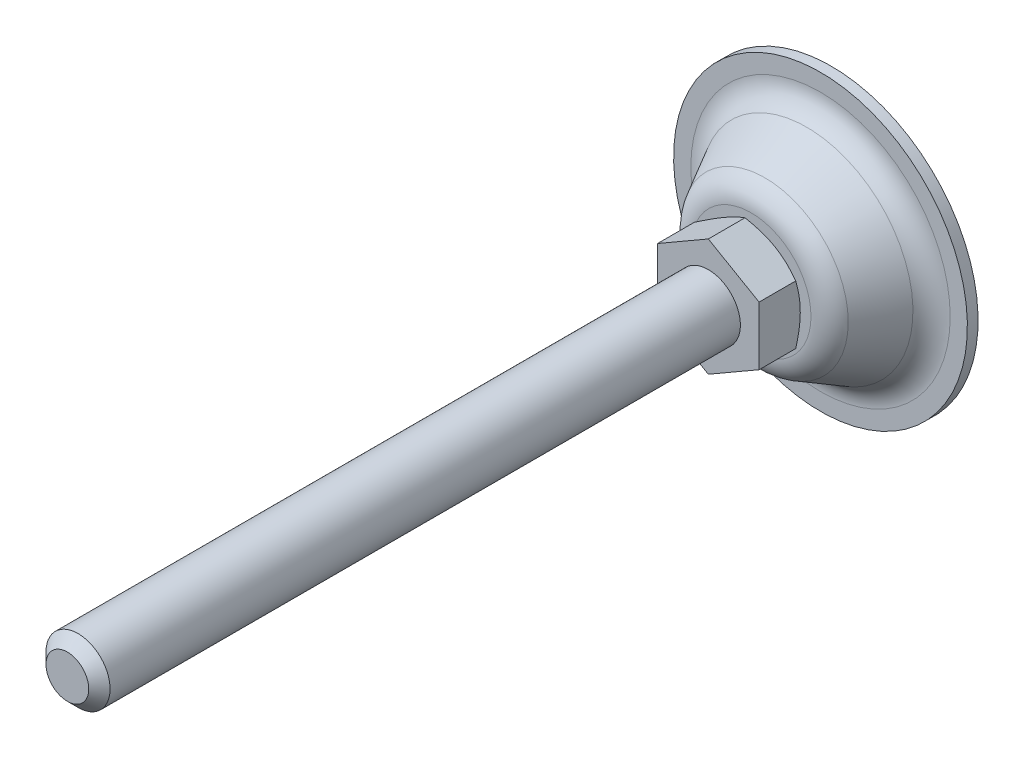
ISO-10303-21;
HEADER;
FILE_DESCRIPTION(('STEP AP214'),'2;1');
FILE_NAME('part.step','',(''),(''),'','','');
FILE_SCHEMA(('AUTOMOTIVE_DESIGN { 1 0 10303 214 1 1 1 1 }'));
ENDSEC;
DATA;
#1=APPLICATION_CONTEXT('core data for automotive mechanical design processes');
#2=APPLICATION_PROTOCOL_DEFINITION('international standard','automotive_design',2000,#1);
#3=PRODUCT_CONTEXT('',#1,'mechanical');
#4=PRODUCT('Part','Part','',(#3));
#5=PRODUCT_RELATED_PRODUCT_CATEGORY('part','',(#4));
#6=PRODUCT_DEFINITION_FORMATION('','',#4);
#7=PRODUCT_DEFINITION_CONTEXT('part definition',#1,'design');
#8=PRODUCT_DEFINITION('design','',#6,#7);
#9=PRODUCT_DEFINITION_SHAPE('','',#8);
#10=(LENGTH_UNIT() NAMED_UNIT(*) SI_UNIT(.MILLI.,.METRE.));
#11=(NAMED_UNIT(*) PLANE_ANGLE_UNIT() SI_UNIT($,.RADIAN.));
#12=(NAMED_UNIT(*) SI_UNIT($,.STERADIAN.) SOLID_ANGLE_UNIT());
#13=UNCERTAINTY_MEASURE_WITH_UNIT(LENGTH_MEASURE(1.E-05),#10,'distance_accuracy_value','');
#14=(GEOMETRIC_REPRESENTATION_CONTEXT(3) GLOBAL_UNCERTAINTY_ASSIGNED_CONTEXT((#13)) GLOBAL_UNIT_ASSIGNED_CONTEXT((#10,
#11,#12)) REPRESENTATION_CONTEXT('',''));
#15=CARTESIAN_POINT('',(0.,0.,0.));
#16=DIRECTION('',(0.,0.,1.));
#17=DIRECTION('',(1.,0.,0.));
#18=AXIS2_PLACEMENT_3D('',#15,#16,#17);
#19=CARTESIAN_POINT('',(0.,0.,23.));
#20=DIRECTION('',(0.,0.,1.));
#21=DIRECTION('',(0.5,-0.866025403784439,0.));
#22=AXIS2_PLACEMENT_3D('',#19,#20,#21);
#23=PLANE('',#22);
#24=DIRECTION('',(0.,1.,0.));
#25=VECTOR('',#24,1.);
#26=CARTESIAN_POINT('',(9.5,-5.48482755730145,23.));
#27=LINE('',#26,#25);
#28=CARTESIAN_POINT('',(9.5,-5.48482755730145,23.));
#29=VERTEX_POINT('',#28);
#30=CARTESIAN_POINT('',(9.5,5.48482755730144,23.));
#31=VERTEX_POINT('',#30);
#32=EDGE_CURVE('E218',#29,#31,#27,.T.);
#33=ORIENTED_EDGE('',*,*,#32,.T.);
#34=DIRECTION('',(-0.866025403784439,0.5,0.));
#35=VECTOR('',#34,1.);
#36=CARTESIAN_POINT('',(9.5,5.48482755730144,23.));
#37=LINE('',#36,#35);
#38=CARTESIAN_POINT('',(0.,10.9696551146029,23.));
#39=VERTEX_POINT('',#38);
#40=EDGE_CURVE('E359',#31,#39,#37,.T.);
#41=ORIENTED_EDGE('',*,*,#40,.T.);
#42=DIRECTION('',(-0.866025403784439,-0.5,0.));
#43=VECTOR('',#42,1.);
#44=CARTESIAN_POINT('',(0.,10.9696551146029,23.));
#45=LINE('',#44,#43);
#46=CARTESIAN_POINT('',(-9.5,5.48482755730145,23.));
#47=VERTEX_POINT('',#46);
#48=EDGE_CURVE('E358',#39,#47,#45,.T.);
#49=ORIENTED_EDGE('',*,*,#48,.T.);
#50=DIRECTION('',(0.,-1.,0.));
#51=VECTOR('',#50,1.);
#52=CARTESIAN_POINT('',(-9.5,5.48482755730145,23.));
#53=LINE('',#52,#51);
#54=CARTESIAN_POINT('',(-9.5,-5.48482755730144,23.));
#55=VERTEX_POINT('',#54);
#56=EDGE_CURVE('E363',#47,#55,#53,.T.);
#57=ORIENTED_EDGE('',*,*,#56,.T.);
#58=DIRECTION('',(0.866025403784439,-0.5,0.));
#59=VECTOR('',#58,1.);
#60=CARTESIAN_POINT('',(-9.5,-5.48482755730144,23.));
#61=LINE('',#60,#59);
#62=CARTESIAN_POINT('',(0.,-10.9696551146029,23.));
#63=VERTEX_POINT('',#62);
#64=EDGE_CURVE('E365',#55,#63,#61,.T.);
#65=ORIENTED_EDGE('',*,*,#64,.T.);
#66=DIRECTION('',(0.866025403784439,0.5,0.));
#67=VECTOR('',#66,1.);
#68=CARTESIAN_POINT('',(0.,-10.9696551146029,23.));
#69=LINE('',#68,#67);
#70=EDGE_CURVE('E37',#63,#29,#69,.T.);
#71=ORIENTED_EDGE('',*,*,#70,.T.);
#72=EDGE_LOOP('',(#33,#41,#49,#57,#65,#71));
#73=FACE_BOUND('',#72,.T.);
#74=CARTESIAN_POINT('',(0.,0.,23.));
#75=DIRECTION('',(0.,0.,1.));
#76=DIRECTION('',(0.5,-0.866025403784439,0.));
#77=AXIS2_PLACEMENT_3D('',#74,#75,#76);
#78=CIRCLE('',#77,6.);
#79=CARTESIAN_POINT('',(3.,-5.19615242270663,23.));
#80=VERTEX_POINT('',#79);
#81=EDGE_CURVE('E222',#80,#80,#78,.T.);
#82=ORIENTED_EDGE('',*,*,#81,.F.);
#83=EDGE_LOOP('',(#82));
#84=FACE_BOUND('',#83,.T.);
#85=ADVANCED_FACE('F14',(#73,#84),#23,.T.);
#86=CARTESIAN_POINT('',(0.,0.,15.));
#87=DIRECTION('',(0.,0.,1.));
#88=DIRECTION('',(0.5,-0.866025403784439,0.));
#89=AXIS2_PLACEMENT_3D('',#86,#87,#88);
#90=PLANE('',#89);
#91=CARTESIAN_POINT('',(0.,0.,15.));
#92=DIRECTION('',(0.,0.,-1.));
#93=DIRECTION('',(-0.5,0.866025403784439,0.));
#94=AXIS2_PLACEMENT_3D('',#91,#92,#93);
#95=CIRCLE('',#94,11.2198194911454);
#96=CARTESIAN_POINT('',(-5.60990974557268,9.71664870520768,15.));
#97=VERTEX_POINT('',#96);
#98=EDGE_CURVE('E102',#97,#97,#95,.T.);
#99=ORIENTED_EDGE('',*,*,#98,.F.);
#100=EDGE_LOOP('',(#99));
#101=FACE_BOUND('',#100,.T.);
#102=CARTESIAN_POINT('',(0.,0.,15.));
#103=DIRECTION('',(0.,0.,-1.));
#104=DIRECTION('',(-0.5,0.866025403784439,0.));
#105=AXIS2_PLACEMENT_3D('',#102,#103,#104);
#106=CIRCLE('',#105,9.);
#107=CARTESIAN_POINT('',(-4.5,7.79422863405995,15.));
#108=VERTEX_POINT('',#107);
#109=EDGE_CURVE('E84',#108,#108,#106,.T.);
#110=ORIENTED_EDGE('',*,*,#109,.T.);
#111=EDGE_LOOP('',(#110));
#112=FACE_BOUND('',#111,.T.);
#113=ADVANCED_FACE('F183',(#101,#112),#90,.T.);
#114=CARTESIAN_POINT('',(0.,0.,0.));
#115=DIRECTION('',(0.,0.,-1.));
#116=DIRECTION('',(-0.5,0.866025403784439,0.));
#117=AXIS2_PLACEMENT_3D('',#114,#115,#116);
#118=PLANE('',#117);
#119=CARTESIAN_POINT('',(0.,0.,0.));
#120=DIRECTION('',(0.,0.,-1.));
#121=DIRECTION('',(-0.5,0.866025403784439,0.));
#122=AXIS2_PLACEMENT_3D('',#119,#120,#121);
#123=CIRCLE('',#122,27.5);
#124=CARTESIAN_POINT('',(-13.75,23.8156986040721,0.));
#125=VERTEX_POINT('',#124);
#126=EDGE_CURVE('E73',#125,#125,#123,.T.);
#127=ORIENTED_EDGE('',*,*,#126,.T.);
#128=EDGE_LOOP('',(#127));
#129=FACE_BOUND('',#128,.T.);
#130=ADVANCED_FACE('F186',(#129),#118,.T.);
#131=CARTESIAN_POINT('',(0.,0.,-9.3525294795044));
#132=DIRECTION('',(0.,0.,-1.));
#133=DIRECTION('',(-0.5,0.866025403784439,0.));
#134=AXIS2_PLACEMENT_3D('',#131,#132,#133);
#135=CYLINDRICAL_SURFACE('',#134,27.5);
#136=CARTESIAN_POINT('',(0.,0.,2.));
#137=DIRECTION('',(0.,0.,-1.));
#138=DIRECTION('',(-0.5,0.866025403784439,0.));
#139=AXIS2_PLACEMENT_3D('',#136,#137,#138);
#140=CIRCLE('',#139,27.5);
#141=CARTESIAN_POINT('',(-13.75,23.8156986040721,2.));
#142=VERTEX_POINT('',#141);
#143=EDGE_CURVE('E114',#142,#142,#140,.T.);
#144=ORIENTED_EDGE('',*,*,#143,.T.);
#145=EDGE_LOOP('',(#144));
#146=FACE_BOUND('',#145,.T.);
#147=ORIENTED_EDGE('',*,*,#126,.F.);
#148=EDGE_LOOP('',(#147));
#149=FACE_BOUND('',#148,.T.);
#150=ADVANCED_FACE('F202',(#146,#149),#135,.T.);
#151=CARTESIAN_POINT('',(-13.75,23.8156986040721,2.));
#152=DIRECTION('',(0.,0.,1.));
#153=DIRECTION('',(0.5,-0.866025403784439,0.));
#154=AXIS2_PLACEMENT_3D('',#151,#152,#153);
#155=PLANE('',#154);
#156=CARTESIAN_POINT('',(0.,0.,2.));
#157=DIRECTION('',(0.,0.,-1.));
#158=DIRECTION('',(-0.5,0.866025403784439,0.));
#159=AXIS2_PLACEMENT_3D('',#156,#157,#158);
#160=CIRCLE('',#159,24.2801624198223);
#161=CARTESIAN_POINT('',(-12.1400812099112,21.0272374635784,2.));
#162=VERTEX_POINT('',#161);
#163=EDGE_CURVE('E111',#162,#162,#160,.T.);
#164=ORIENTED_EDGE('',*,*,#163,.T.);
#165=EDGE_LOOP('',(#164));
#166=FACE_BOUND('',#165,.T.);
#167=ORIENTED_EDGE('',*,*,#143,.F.);
#168=EDGE_LOOP('',(#167));
#169=FACE_BOUND('',#168,.T.);
#170=ADVANCED_FACE('F198',(#166,#169),#155,.T.);
#171=CARTESIAN_POINT('',(0.,0.,7.));
#172=DIRECTION('',(0.,0.,-1.));
#173=DIRECTION('',(-0.5,0.866025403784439,0.));
#174=AXIS2_PLACEMENT_3D('',#171,#172,#173);
#175=TOROIDAL_SURFACE('',#174,24.2801624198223,5.);
#176=CARTESIAN_POINT('',(0.,0.,4.59142577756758));
#177=DIRECTION('',(0.,0.,-1.));
#178=DIRECTION('',(-0.5,0.866025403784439,0.));
#179=AXIS2_PLACEMENT_3D('',#176,#177,#178);
#180=CIRCLE('',#179,19.8985222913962);
#181=CARTESIAN_POINT('',(-9.9492611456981,17.2326258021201,4.59142577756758));
#182=VERTEX_POINT('',#181);
#183=EDGE_CURVE('E108',#182,#182,#180,.T.);
#184=ORIENTED_EDGE('',*,*,#183,.T.);
#185=EDGE_LOOP('',(#184));
#186=FACE_BOUND('',#185,.T.);
#187=ORIENTED_EDGE('',*,*,#163,.F.);
#188=EDGE_LOOP('',(#187));
#189=FACE_BOUND('',#188,.T.);
#190=ADVANCED_FACE('F194',(#186,#189),#175,.F.);
#191=CARTESIAN_POINT('',(0.,0.,4.59142577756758));
#192=DIRECTION('',(0.,0.,-1.));
#193=DIRECTION('',(-0.5,0.866025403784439,0.));
#194=AXIS2_PLACEMENT_3D('',#191,#192,#193);
#195=CONICAL_SURFACE('',#194,19.8985222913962,0.50261051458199);
#196=CARTESIAN_POINT('',(0.,0.,12.4085742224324));
#197=DIRECTION('',(0.,0.,-1.));
#198=DIRECTION('',(-0.5,0.866025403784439,0.));
#199=AXIS2_PLACEMENT_3D('',#196,#197,#198);
#200=CIRCLE('',#199,15.6014596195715);
#201=CARTESIAN_POINT('',(-7.80072980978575,13.511260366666,12.4085742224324));
#202=VERTEX_POINT('',#201);
#203=EDGE_CURVE('E105',#202,#202,#200,.T.);
#204=ORIENTED_EDGE('',*,*,#203,.T.);
#205=EDGE_LOOP('',(#204));
#206=FACE_BOUND('',#205,.T.);
#207=ORIENTED_EDGE('',*,*,#183,.F.);
#208=EDGE_LOOP('',(#207));
#209=FACE_BOUND('',#208,.T.);
#210=ADVANCED_FACE('F190',(#206,#209),#195,.T.);
#211=CARTESIAN_POINT('',(0.,0.,10.));
#212=DIRECTION('',(0.,0.,-1.));
#213=DIRECTION('',(-0.5,0.866025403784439,0.));
#214=AXIS2_PLACEMENT_3D('',#211,#212,#213);
#215=TOROIDAL_SURFACE('',#214,11.2198194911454,5.);
#216=ORIENTED_EDGE('',*,*,#98,.T.);
#217=EDGE_LOOP('',(#216));
#218=FACE_BOUND('',#217,.T.);
#219=ORIENTED_EDGE('',*,*,#203,.F.);
#220=EDGE_LOOP('',(#219));
#221=FACE_BOUND('',#220,.T.);
#222=ADVANCED_FACE('F130',(#218,#221),#215,.T.);
#223=CARTESIAN_POINT('',(0.,0.,18.9793107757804));
#224=DIRECTION('',(0.,0.,1.));
#225=DIRECTION('',(0.5,-0.866025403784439,0.));
#226=AXIS2_PLACEMENT_3D('',#223,#224,#225);
#227=CONICAL_SURFACE('',#226,15.8923684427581,1.0471975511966);
#228=ORIENTED_EDGE('',*,*,#109,.F.);
#229=EDGE_LOOP('',(#228));
#230=FACE_BOUND('',#229,.T.);
#231=CARTESIAN_POINT('',(-8.15701159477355,-15.6791079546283,20.0079523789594));
#232=CARTESIAN_POINT('',(-7.97671168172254,-15.5750117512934,19.9065949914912));
#233=CARTESIAN_POINT('',(-7.79620414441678,-15.4707956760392,19.8057302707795));
#234=CARTESIAN_POINT('',(-7.43473055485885,-15.262098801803,19.6050974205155));
#235=CARTESIAN_POINT('',(-7.25376449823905,-15.1576180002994,19.5053293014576));
#236=CARTESIAN_POINT('',(-6.71006743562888,-14.8437143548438,19.2078115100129));
#237=CARTESIAN_POINT('',(-6.34658864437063,-14.6338597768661,19.0118772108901));
#238=CARTESIAN_POINT('',(-5.6153393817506,-14.2116728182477,18.6249838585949));
#239=CARTESIAN_POINT('',(-5.24755640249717,-13.9993332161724,18.4340562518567));
#240=CARTESIAN_POINT('',(-4.5091170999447,-13.5729950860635,18.059786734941));
#241=CARTESIAN_POINT('',(-4.13846090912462,-13.3589966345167,17.8764444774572));
#242=CARTESIAN_POINT('',(-3.38118032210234,-12.9217804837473,17.5133517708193));
#243=CARTESIAN_POINT('',(-2.99443761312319,-12.6984944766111,17.3339285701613));
#244=CARTESIAN_POINT('',(-2.21648353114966,-12.2493424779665,16.9882522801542));
#245=CARTESIAN_POINT('',(-1.82527167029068,-12.0234762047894,16.8220006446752));
#246=CARTESIAN_POINT('',(-1.03843766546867,-11.5691973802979,16.5069077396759));
#247=CARTESIAN_POINT('',(-0.642825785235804,-11.3407907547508,16.3580326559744));
#248=CARTESIAN_POINT('',(0.154057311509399,-10.8807100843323,16.0823550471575));
#249=CARTESIAN_POINT('',(0.555326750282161,-10.6490370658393,15.9555457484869));
#250=CARTESIAN_POINT('',(1.36156962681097,-10.1835525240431,15.730660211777));
#251=CARTESIAN_POINT('',(1.7665083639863,-9.94976103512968,15.6324225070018));
#252=CARTESIAN_POINT('',(2.37771950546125,-9.59687811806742,15.5106601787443));
#253=CARTESIAN_POINT('',(2.58210426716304,-9.47887652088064,15.4743368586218));
#254=CARTESIAN_POINT('',(2.99193920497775,-9.24225820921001,15.4109296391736));
#255=CARTESIAN_POINT('',(3.19738927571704,-9.12364155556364,15.3838448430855));
#256=CARTESIAN_POINT('',(3.60633071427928,-8.88753910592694,15.3398031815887));
#257=CARTESIAN_POINT('',(3.80981147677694,-8.77005943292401,15.3227155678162));
#258=CARTESIAN_POINT('',(4.21721696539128,-8.53484376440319,15.2984994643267));
#259=CARTESIAN_POINT('',(4.42114168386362,-8.41710777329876,15.2913708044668));
#260=CARTESIAN_POINT('',(4.82906985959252,-8.18159033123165,15.2872433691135));
#261=CARTESIAN_POINT('',(5.03307331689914,-8.06380888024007,15.2902446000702));
#262=CARTESIAN_POINT('',(5.44078563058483,-7.8284160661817,15.3063014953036));
#263=CARTESIAN_POINT('',(5.64449447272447,-7.71080471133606,15.3193576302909));
#264=CARTESIAN_POINT('',(6.12963344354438,-7.43070959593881,15.3621439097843));
#265=CARTESIAN_POINT('',(6.41077353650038,-7.26839328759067,15.3963598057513));
#266=CARTESIAN_POINT('',(6.97105016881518,-6.94491742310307,15.482114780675));
#267=CARTESIAN_POINT('',(7.25018644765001,-6.7837580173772,15.5336560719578));
#268=CARTESIAN_POINT('',(8.08422220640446,-6.30222724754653,15.7115431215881));
#269=CARTESIAN_POINT('',(8.63545892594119,-5.98397057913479,15.8611230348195));
#270=CARTESIAN_POINT('',(9.45994897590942,-5.50795102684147,16.1217474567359));
#271=CARTESIAN_POINT('',(9.73744916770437,-5.34773621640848,16.2159197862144));
#272=CARTESIAN_POINT('',(10.289756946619,-5.0288611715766,16.4143552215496));
#273=CARTESIAN_POINT('',(10.5645645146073,-4.87020094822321,16.5186183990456));
#274=CARTESIAN_POINT('',(11.1115689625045,-4.55438778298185,16.7355370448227));
#275=CARTESIAN_POINT('',(11.3837665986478,-4.39723440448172,16.8481899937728));
#276=CARTESIAN_POINT('',(11.9258880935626,-4.08424041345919,17.0805318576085));
#277=CARTESIAN_POINT('',(12.1958119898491,-3.92839977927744,17.2002206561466));
#278=CARTESIAN_POINT('',(12.8727098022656,-3.53759264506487,17.5088865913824));
#279=CARTESIAN_POINT('',(13.278374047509,-3.30338228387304,17.7016878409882));
#280=CARTESIAN_POINT('',(14.0858986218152,-2.83715775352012,18.0976682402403));
#281=CARTESIAN_POINT('',(14.4877586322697,-2.60514376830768,18.3008482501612));
#282=CARTESIAN_POINT('',(15.2884562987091,-2.14286075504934,18.7153364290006));
#283=CARTESIAN_POINT('',(15.6872930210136,-1.91259226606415,18.9266469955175));
#284=CARTESIAN_POINT('',(16.4823758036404,-1.45355100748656,19.3556165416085));
#285=CARTESIAN_POINT('',(16.8786219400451,-1.22477819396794,19.5732753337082));
#286=CARTESIAN_POINT('',(17.6695213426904,-0.768152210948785,20.0139591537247));
#287=CARTESIAN_POINT('',(18.0641717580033,-0.540300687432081,20.2369909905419));
#288=CARTESIAN_POINT('',(18.8517115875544,-0.0856143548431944,20.6871626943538));
#289=CARTESIAN_POINT('',(19.2446009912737,0.141220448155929,20.9143025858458));
#290=CARTESIAN_POINT('',(20.0288426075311,0.594002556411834,21.3718987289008));
#291=CARTESIAN_POINT('',(20.4201950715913,0.819950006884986,21.6023544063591));
#292=CARTESIAN_POINT('',(21.2016656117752,1.27113223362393,22.0660411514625));
#293=CARTESIAN_POINT('',(21.5917836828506,1.49636700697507,22.2992722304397));
#294=CARTESIAN_POINT('',(22.6873922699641,2.1289169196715,22.9583931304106));
#295=CARTESIAN_POINT('',(23.3916953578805,2.53554649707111,23.3869143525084));
#296=CARTESIAN_POINT('',(24.7977714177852,3.34734488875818,24.2495346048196));
#297=CARTESIAN_POINT('',(25.499544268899,3.75251363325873,24.6836338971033));
#298=CARTESIAN_POINT('',(26.8990618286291,4.56052547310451,25.5547677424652));
#299=CARTESIAN_POINT('',(27.5968123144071,4.96337190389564,25.991789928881));
#300=CARTESIAN_POINT('',(28.6422636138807,5.56696349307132,26.6497454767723));
#301=CARTESIAN_POINT('',(28.9905403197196,5.76804114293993,26.8694605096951));
#302=CARTESIAN_POINT('',(29.6867494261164,6.16999765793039,27.3096154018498));
#303=CARTESIAN_POINT('',(30.0346818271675,6.37087652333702,27.5300552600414));
#304=CARTESIAN_POINT('',(30.3824623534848,6.57166770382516,27.7508142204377));
#305=B_SPLINE_CURVE_WITH_KNOTS('',3,(#231,#232,#233,#234,#235,#236,#237,#238,#239,#240,#241,
#242,#243,#244,#245,#246,#247,#248,#249,#250,#251,#252,#253,#254,#255,#256,#257,#258,#259,#260,
#261,#262,#263,#264,#265,#266,#267,#268,#269,#270,#271,#272,#273,#274,#275,#276,#277,#278,#279,
#280,#281,#282,#283,#284,#285,#286,#287,#288,#289,#290,#291,#292,#293,#294,#295,#296,#297,#298,
#299,#300,#301,#302,#303,#304),.UNSPECIFIED.,.F.,.F.,(4,2,2,2,2,2,2,2,2,2,2,2,2,2,2,2,2,2,2,2,2,
2,2,2,2,2,2,2,2,2,2,2,2,2,2,2,4),(0.,0.694661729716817,1.3893301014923,2.77886384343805,
4.17567800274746,5.57242813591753,7.01607199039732,8.45987497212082,9.90081979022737,
11.3413214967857,12.7735168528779,13.4897108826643,14.2058353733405,14.9123716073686,
15.6188957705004,16.3254203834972,17.0319780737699,18.0107209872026,18.9895889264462,
20.9483275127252,21.9501834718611,22.9520465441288,23.9536099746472,24.9551568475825,
26.4746221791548,27.9942136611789,29.5142567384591,31.0342549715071,32.5562928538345,
34.0783398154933,35.6001263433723,37.1219190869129,39.8796363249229,42.6374836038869,
45.3872304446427,46.7620143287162,48.1367962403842),.UNSPECIFIED.);
#306=CARTESIAN_POINT('',(0.,-10.9696551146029,16.1371809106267));
#307=VERTEX_POINT('',#306);
#308=CARTESIAN_POINT('',(9.5,-5.48482755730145,16.1371809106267));
#309=VERTEX_POINT('',#308);
#310=EDGE_CURVE('E65',#307,#309,#305,.T.);
#311=ORIENTED_EDGE('',*,*,#310,.F.);
#312=CARTESIAN_POINT('',(-9.5002,-5.4847120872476,16.137247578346));
#313=CARTESIAN_POINT('',(-9.29136922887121,-5.60528058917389,16.0676485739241));
#314=CARTESIAN_POINT('',(-9.0817598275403,-5.72629863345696,16.001208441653));
#315=CARTESIAN_POINT('',(-8.66086011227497,-5.96930519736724,15.8755224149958));
#316=CARTESIAN_POINT('',(-8.44956926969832,-6.09129402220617,15.8162788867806));
#317=CARTESIAN_POINT('',(-7.81229220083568,-6.45922610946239,15.6504897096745));
#318=CARTESIAN_POINT('',(-7.38379023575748,-6.70662183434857,15.5561895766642));
#319=CARTESIAN_POINT('',(-6.74255666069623,-7.07683821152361,15.4456138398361));
#320=CARTESIAN_POINT('',(-6.53174078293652,-7.19855281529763,15.4141149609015));
#321=CARTESIAN_POINT('',(-6.10913296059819,-7.4425455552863,15.3612933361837));
#322=CARTESIAN_POINT('',(-5.89734099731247,-7.56482370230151,15.3399707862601));
#323=CARTESIAN_POINT('',(-5.47340378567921,-7.80958396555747,15.3080481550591));
#324=CARTESIAN_POINT('',(-5.26125925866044,-7.93206566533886,15.2974353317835));
#325=CARTESIAN_POINT('',(-4.83677424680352,-8.17714220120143,15.2871576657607));
#326=CARTESIAN_POINT('',(-4.62443376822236,-8.29973703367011,15.2874924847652));
#327=CARTESIAN_POINT('',(-4.22745800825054,-8.5289310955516,15.2983485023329));
#328=CARTESIAN_POINT('',(-4.04279470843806,-8.63554650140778,15.307545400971));
#329=CARTESIAN_POINT('',(-3.67389999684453,-8.84852796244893,15.3340405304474));
#330=CARTESIAN_POINT('',(-3.48966861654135,-8.95489399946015,15.3513393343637));
#331=CARTESIAN_POINT('',(-2.93768832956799,-9.27357996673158,15.4149796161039));
#332=CARTESIAN_POINT('',(-2.57091646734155,-9.48533580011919,15.4730570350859));
#333=CARTESIAN_POINT('',(-1.83348217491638,-9.91109368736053,15.618251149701));
#334=CARTESIAN_POINT('',(-1.46291385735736,-10.1250414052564,15.7059833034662));
#335=CARTESIAN_POINT('',(-0.727303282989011,-10.5497463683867,15.9050988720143));
#336=CARTESIAN_POINT('',(-0.362251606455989,-10.7605090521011,16.0164355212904));
#337=CARTESIAN_POINT('',(0.000200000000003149,-10.9697705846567,16.137247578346));
#338=B_SPLINE_CURVE_WITH_KNOTS('',3,(#312,#313,#314,#315,#316,#317,#318,#319,#320,#321,#322,
#323,#324,#325,#326,#327,#328,#329,#330,#331,#332,#333,#334,#335,#336,#337),.UNSPECIFIED.,.F.,
.F.,(4,2,2,2,2,2,2,2,2,2,2,2,4),(0.,0.752880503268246,1.50600787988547,3.01546870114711,
3.75167336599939,4.48789219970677,5.22323407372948,5.95855322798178,6.59868084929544,
7.238853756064,8.5201092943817,9.82978009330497,11.1368800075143),.UNSPECIFIED.);
#339=CARTESIAN_POINT('',(-9.5,-5.48482755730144,16.1371809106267));
#340=VERTEX_POINT('',#339);
#341=EDGE_CURVE('E68',#340,#307,#338,.T.);
#342=ORIENTED_EDGE('',*,*,#341,.F.);
#343=CARTESIAN_POINT('',(-9.5,5.48505849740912,16.137247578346));
#344=CARTESIAN_POINT('',(-9.5,5.24392149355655,16.0676485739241));
#345=CARTESIAN_POINT('',(-9.5,5.0018854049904,16.001208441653));
#346=CARTESIAN_POINT('',(-9.5,4.51587227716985,15.8755224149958));
#347=CARTESIAN_POINT('',(-9.5,4.27189462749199,15.8162788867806));
#348=CARTESIAN_POINT('',(-9.5,3.53603045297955,15.6504897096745));
#349=CARTESIAN_POINT('',(-9.5,3.04123900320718,15.5561895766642));
#350=CARTESIAN_POINT('',(-9.5,2.30080624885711,15.4456138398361));
#351=CARTESIAN_POINT('',(-9.5,2.05737704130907,15.4141149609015));
#352=CARTESIAN_POINT('',(-9.5,1.56939156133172,15.3612933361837));
#353=CARTESIAN_POINT('',(-9.5,1.3248352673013,15.3399707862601));
#354=CARTESIAN_POINT('',(-9.5,0.835314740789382,15.3080481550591));
#355=CARTESIAN_POINT('',(-9.5,0.590351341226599,15.2974353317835));
#356=CARTESIAN_POINT('',(-9.5,0.100198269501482,15.2871576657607));
#357=CARTESIAN_POINT('',(-9.5,-0.144991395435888,15.2874924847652));
#358=CARTESIAN_POINT('',(-9.5,-0.603379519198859,15.2983485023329));
#359=CARTESIAN_POINT('',(-9.5,-0.816610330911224,15.307545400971));
#360=CARTESIAN_POINT('',(-9.5,-1.24257325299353,15.3340405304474));
#361=CARTESIAN_POINT('',(-9.5,-1.45530532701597,15.3513393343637));
#362=CARTESIAN_POINT('',(-9.5,-2.09267726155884,15.4149796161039));
#363=CARTESIAN_POINT('',(-9.5,-2.51618892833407,15.4730570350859));
#364=CARTESIAN_POINT('',(-9.5,-3.36770470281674,15.618251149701));
#365=CARTESIAN_POINT('',(-9.5,-3.79560013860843,15.7059833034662));
#366=CARTESIAN_POINT('',(-9.5,-4.64501006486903,15.9050988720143));
#367=CARTESIAN_POINT('',(-9.5,-5.06653543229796,16.0164355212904));
#368=CARTESIAN_POINT('',(-9.5,-5.48505849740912,16.137247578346));
#369=B_SPLINE_CURVE_WITH_KNOTS('',3,(#343,#344,#345,#346,#347,#348,#349,#350,#351,#352,#353,
#354,#355,#356,#357,#358,#359,#360,#361,#362,#363,#364,#365,#366,#367,#368),.UNSPECIFIED.,.F.,
.F.,(4,2,2,2,2,2,2,2,2,2,2,2,4),(0.,0.752880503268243,1.50600787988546,3.01546870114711,
3.75167336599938,4.48789219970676,5.22323407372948,5.95855322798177,6.59868084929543,
7.23885375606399,8.5201092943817,9.82978009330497,11.1368800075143),.UNSPECIFIED.);
#370=CARTESIAN_POINT('',(-9.5,5.48482755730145,16.1371809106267));
#371=VERTEX_POINT('',#370);
#372=EDGE_CURVE('E83',#371,#340,#369,.T.);
#373=ORIENTED_EDGE('',*,*,#372,.F.);
#374=CARTESIAN_POINT('',(-17.6570115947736,0.775374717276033,20.0079523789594));
#375=CARTESIAN_POINT('',(-17.4767116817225,0.87947092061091,19.9065949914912));
#376=CARTESIAN_POINT('',(-17.2962041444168,0.98368699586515,19.8057302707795));
#377=CARTESIAN_POINT('',(-16.9347305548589,1.19238387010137,19.6050974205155));
#378=CARTESIAN_POINT('',(-16.7537644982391,1.29686467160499,19.5053293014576));
#379=CARTESIAN_POINT('',(-16.2100674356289,1.61076831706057,19.2078115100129));
#380=CARTESIAN_POINT('',(-15.8465886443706,1.82062289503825,19.0118772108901));
#381=CARTESIAN_POINT('',(-15.1153393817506,2.24280985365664,18.6249838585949));
#382=CARTESIAN_POINT('',(-14.7475564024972,2.45514945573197,18.4340562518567));
#383=CARTESIAN_POINT('',(-14.0091170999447,2.88148758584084,18.059786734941));
#384=CARTESIAN_POINT('',(-13.6384609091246,3.09548603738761,17.8764444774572));
#385=CARTESIAN_POINT('',(-12.8811803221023,3.532702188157,17.5133517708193));
#386=CARTESIAN_POINT('',(-12.4944376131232,3.75598819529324,17.3339285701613));
#387=CARTESIAN_POINT('',(-11.7164835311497,4.20514019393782,16.9882522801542));
#388=CARTESIAN_POINT('',(-11.3252716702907,4.43100646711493,16.8220006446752));
#389=CARTESIAN_POINT('',(-10.5384376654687,4.88528529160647,16.5069077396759));
#390=CARTESIAN_POINT('',(-10.1428257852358,5.11369191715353,16.3580326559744));
#391=CARTESIAN_POINT('',(-9.3459426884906,5.57377258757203,16.0823550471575));
#392=CARTESIAN_POINT('',(-8.94467324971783,5.80544560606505,15.9555457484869));
#393=CARTESIAN_POINT('',(-8.13843037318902,6.27093014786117,15.730660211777));
#394=CARTESIAN_POINT('',(-7.73349163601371,6.50472163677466,15.6324225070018));
#395=CARTESIAN_POINT('',(-7.12228049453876,6.85760455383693,15.5106601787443));
#396=CARTESIAN_POINT('',(-6.91789573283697,6.97560615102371,15.4743368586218));
#397=CARTESIAN_POINT('',(-6.50806079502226,7.21222446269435,15.4109296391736));
#398=CARTESIAN_POINT('',(-6.30261072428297,7.33084111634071,15.3838448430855));
#399=CARTESIAN_POINT('',(-5.89366928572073,7.56694356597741,15.3398031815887));
#400=CARTESIAN_POINT('',(-5.69018852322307,7.68442323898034,15.3227155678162));
#401=CARTESIAN_POINT('',(-5.28278303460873,7.91963890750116,15.2984994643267));
#402=CARTESIAN_POINT('',(-5.07885831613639,8.03737489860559,15.2913708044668));
#403=CARTESIAN_POINT('',(-4.67093014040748,8.2728923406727,15.2872433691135));
#404=CARTESIAN_POINT('',(-4.46692668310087,8.39067379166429,15.2902446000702));
#405=CARTESIAN_POINT('',(-4.05921436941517,8.62606660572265,15.3063014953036));
#406=CARTESIAN_POINT('',(-3.85550552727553,8.74367796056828,15.3193576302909));
#407=CARTESIAN_POINT('',(-3.37036655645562,9.02377307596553,15.3621439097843));
#408=CARTESIAN_POINT('',(-3.08922646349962,9.18608938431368,15.3963598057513));
#409=CARTESIAN_POINT('',(-2.52894983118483,9.50956524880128,15.482114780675));
#410=CARTESIAN_POINT('',(-2.24981355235,9.67072465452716,15.5336560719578));
#411=CARTESIAN_POINT('',(-1.41577779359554,10.1522554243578,15.7115431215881));
#412=CARTESIAN_POINT('',(-0.864541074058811,10.4705120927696,15.8611230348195));
#413=CARTESIAN_POINT('',(-0.0400510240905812,10.9465316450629,16.1217474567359));
#414=CARTESIAN_POINT('',(0.237449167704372,11.1067464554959,16.2159197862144));
#415=CARTESIAN_POINT('',(0.789756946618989,11.4256215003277,16.4143552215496));
#416=CARTESIAN_POINT('',(1.06456451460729,11.5842817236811,16.5186183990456));
#417=CARTESIAN_POINT('',(1.61156896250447,11.9000948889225,16.7355370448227));
#418=CARTESIAN_POINT('',(1.88376659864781,12.0572482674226,16.8481899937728));
#419=CARTESIAN_POINT('',(2.42588809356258,12.3702422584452,17.0805318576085));
#420=CARTESIAN_POINT('',(2.69581198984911,12.5260828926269,17.2002206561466));
#421=CARTESIAN_POINT('',(3.37270980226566,12.9168900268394,17.5088865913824));
#422=CARTESIAN_POINT('',(3.77837404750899,13.1511003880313,17.7016878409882));
#423=CARTESIAN_POINT('',(4.5858986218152,13.6173249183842,18.0976682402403));
#424=CARTESIAN_POINT('',(4.98775863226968,13.8493389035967,18.3008482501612));
#425=CARTESIAN_POINT('',(5.78845629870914,14.311621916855,18.7153364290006));
#426=CARTESIAN_POINT('',(6.18729302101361,14.5418904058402,18.9266469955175));
#427=CARTESIAN_POINT('',(6.98237580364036,15.0009316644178,19.3556165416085));
#428=CARTESIAN_POINT('',(7.37862194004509,15.2297044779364,19.5732753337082));
#429=CARTESIAN_POINT('',(8.16952134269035,15.6863304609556,20.0139591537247));
#430=CARTESIAN_POINT('',(8.56417175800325,15.9141819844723,20.2369909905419));
#431=CARTESIAN_POINT('',(9.35171158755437,16.3688683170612,20.6871626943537));
#432=CARTESIAN_POINT('',(9.74460099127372,16.5957031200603,20.9143025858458));
#433=CARTESIAN_POINT('',(10.5288426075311,17.0484852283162,21.3718987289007));
#434=CARTESIAN_POINT('',(10.9201950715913,17.2744326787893,21.6023544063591));
#435=CARTESIAN_POINT('',(11.7016656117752,17.7256149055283,22.0660411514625));
#436=CARTESIAN_POINT('',(12.0917836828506,17.9508496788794,22.2992722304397));
#437=CARTESIAN_POINT('',(13.1873922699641,18.5833995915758,22.9583931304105));
#438=CARTESIAN_POINT('',(13.8916953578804,18.9900291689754,23.3869143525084));
#439=CARTESIAN_POINT('',(15.2977714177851,19.8018275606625,24.2495346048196));
#440=CARTESIAN_POINT('',(15.999544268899,20.2069963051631,24.6836338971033));
#441=CARTESIAN_POINT('',(17.3990618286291,21.0150081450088,25.5547677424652));
#442=CARTESIAN_POINT('',(18.0968123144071,21.4178545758,25.991789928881));
#443=CARTESIAN_POINT('',(19.1422636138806,22.0214461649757,26.6497454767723));
#444=CARTESIAN_POINT('',(19.4905403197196,22.2225238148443,26.869460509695));
#445=CARTESIAN_POINT('',(20.1867494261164,22.6244803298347,27.3096154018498));
#446=CARTESIAN_POINT('',(20.5346818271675,22.8253591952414,27.5300552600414));
#447=CARTESIAN_POINT('',(20.8824623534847,23.0261503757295,27.7508142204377));
#448=B_SPLINE_CURVE_WITH_KNOTS('',3,(#374,#375,#376,#377,#378,#379,#380,#381,#382,#383,#384,
#385,#386,#387,#388,#389,#390,#391,#392,#393,#394,#395,#396,#397,#398,#399,#400,#401,#402,#403,
#404,#405,#406,#407,#408,#409,#410,#411,#412,#413,#414,#415,#416,#417,#418,#419,#420,#421,#422,
#423,#424,#425,#426,#427,#428,#429,#430,#431,#432,#433,#434,#435,#436,#437,#438,#439,#440,#441,
#442,#443,#444,#445,#446,#447),.UNSPECIFIED.,.F.,.F.,(4,2,2,2,2,2,2,2,2,2,2,2,2,2,2,2,2,2,2,2,2,
2,2,2,2,2,2,2,2,2,2,2,2,2,2,2,4),(0.,0.694661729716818,1.38933010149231,2.77886384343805,
4.17567800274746,5.57242813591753,7.01607199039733,8.45987497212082,9.90081979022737,
11.3413214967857,12.7735168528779,13.4897108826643,14.2058353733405,14.9123716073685,
15.6188957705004,16.3254203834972,17.0319780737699,18.0107209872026,18.9895889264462,
20.9483275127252,21.9501834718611,22.9520465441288,23.9536099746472,24.9551568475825,
26.4746221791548,27.9942136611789,29.5142567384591,31.0342549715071,32.5562928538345,
34.0783398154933,35.6001263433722,37.1219190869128,39.8796363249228,42.6374836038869,
45.3872304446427,46.7620143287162,48.1367962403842),.UNSPECIFIED.);
#449=CARTESIAN_POINT('',(0.,10.9696551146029,16.1371809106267));
#450=VERTEX_POINT('',#449);
#451=EDGE_CURVE('E152',#450,#371,#448,.F.);
#452=ORIENTED_EDGE('',*,*,#451,.F.);
#453=CARTESIAN_POINT('',(9.5002,5.4847120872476,16.137247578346));
#454=CARTESIAN_POINT('',(9.29136922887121,5.60528058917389,16.0676485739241));
#455=CARTESIAN_POINT('',(9.0817598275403,5.72629863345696,16.001208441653));
#456=CARTESIAN_POINT('',(8.66086011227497,5.96930519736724,15.8755224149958));
#457=CARTESIAN_POINT('',(8.44956926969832,6.09129402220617,15.8162788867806));
#458=CARTESIAN_POINT('',(7.81229220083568,6.45922610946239,15.6504897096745));
#459=CARTESIAN_POINT('',(7.38379023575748,6.70662183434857,15.5561895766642));
#460=CARTESIAN_POINT('',(6.74255666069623,7.07683821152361,15.4456138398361));
#461=CARTESIAN_POINT('',(6.53174078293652,7.19855281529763,15.4141149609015));
#462=CARTESIAN_POINT('',(6.10913296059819,7.4425455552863,15.3612933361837));
#463=CARTESIAN_POINT('',(5.89734099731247,7.56482370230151,15.3399707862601));
#464=CARTESIAN_POINT('',(5.47340378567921,7.80958396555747,15.3080481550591));
#465=CARTESIAN_POINT('',(5.26125925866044,7.93206566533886,15.2974353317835));
#466=CARTESIAN_POINT('',(4.83677424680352,8.17714220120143,15.2871576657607));
#467=CARTESIAN_POINT('',(4.62443376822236,8.29973703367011,15.2874924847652));
#468=CARTESIAN_POINT('',(4.22745800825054,8.5289310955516,15.2983485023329));
#469=CARTESIAN_POINT('',(4.04279470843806,8.63554650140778,15.307545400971));
#470=CARTESIAN_POINT('',(3.67389999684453,8.84852796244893,15.3340405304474));
#471=CARTESIAN_POINT('',(3.48966861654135,8.95489399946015,15.3513393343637));
#472=CARTESIAN_POINT('',(2.93768832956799,9.27357996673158,15.4149796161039));
#473=CARTESIAN_POINT('',(2.57091646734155,9.48533580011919,15.4730570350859));
#474=CARTESIAN_POINT('',(1.83348217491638,9.91109368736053,15.618251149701));
#475=CARTESIAN_POINT('',(1.46291385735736,10.1250414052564,15.7059833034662));
#476=CARTESIAN_POINT('',(0.727303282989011,10.5497463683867,15.9050988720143));
#477=CARTESIAN_POINT('',(0.362251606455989,10.7605090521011,16.0164355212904));
#478=CARTESIAN_POINT('',(-0.000200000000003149,10.9697705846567,16.137247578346));
#479=B_SPLINE_CURVE_WITH_KNOTS('',3,(#453,#454,#455,#456,#457,#458,#459,#460,#461,#462,#463,
#464,#465,#466,#467,#468,#469,#470,#471,#472,#473,#474,#475,#476,#477,#478),.UNSPECIFIED.,.F.,
.F.,(4,2,2,2,2,2,2,2,2,2,2,2,4),(0.,0.752880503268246,1.50600787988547,3.01546870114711,
3.75167336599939,4.48789219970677,5.22323407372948,5.95855322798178,6.59868084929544,
7.238853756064,8.5201092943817,9.82978009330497,11.1368800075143),.UNSPECIFIED.);
#480=CARTESIAN_POINT('',(9.5,5.48482755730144,16.1371809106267));
#481=VERTEX_POINT('',#480);
#482=EDGE_CURVE('E159',#481,#450,#479,.T.);
#483=ORIENTED_EDGE('',*,*,#482,.F.);
#484=CARTESIAN_POINT('',(9.5,-5.48505849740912,16.137247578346));
#485=CARTESIAN_POINT('',(9.5,-5.24392149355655,16.0676485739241));
#486=CARTESIAN_POINT('',(9.5,-5.0018854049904,16.001208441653));
#487=CARTESIAN_POINT('',(9.5,-4.51587227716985,15.8755224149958));
#488=CARTESIAN_POINT('',(9.5,-4.27189462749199,15.8162788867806));
#489=CARTESIAN_POINT('',(9.5,-3.53603045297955,15.6504897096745));
#490=CARTESIAN_POINT('',(9.5,-3.04123900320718,15.5561895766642));
#491=CARTESIAN_POINT('',(9.5,-2.3008062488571,15.4456138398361));
#492=CARTESIAN_POINT('',(9.5,-2.05737704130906,15.4141149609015));
#493=CARTESIAN_POINT('',(9.5,-1.56939156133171,15.3612933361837));
#494=CARTESIAN_POINT('',(9.5,-1.32483526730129,15.3399707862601));
#495=CARTESIAN_POINT('',(9.5,-0.835314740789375,15.3080481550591));
#496=CARTESIAN_POINT('',(9.5,-0.590351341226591,15.2974353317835));
#497=CARTESIAN_POINT('',(9.5,-0.100198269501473,15.2871576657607));
#498=CARTESIAN_POINT('',(9.5,0.144991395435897,15.2874924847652));
#499=CARTESIAN_POINT('',(9.5,0.603379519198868,15.2983485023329));
#500=CARTESIAN_POINT('',(9.5,0.816610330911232,15.307545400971));
#501=CARTESIAN_POINT('',(9.5,1.24257325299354,15.3340405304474));
#502=CARTESIAN_POINT('',(9.5,1.45530532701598,15.3513393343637));
#503=CARTESIAN_POINT('',(9.5,2.09267726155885,15.4149796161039));
#504=CARTESIAN_POINT('',(9.5,2.51618892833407,15.4730570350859));
#505=CARTESIAN_POINT('',(9.5,3.36770470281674,15.618251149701));
#506=CARTESIAN_POINT('',(9.5,3.79560013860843,15.7059833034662));
#507=CARTESIAN_POINT('',(9.5,4.64501006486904,15.9050988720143));
#508=CARTESIAN_POINT('',(9.5,5.06653543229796,16.0164355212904));
#509=CARTESIAN_POINT('',(9.5,5.48505849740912,16.137247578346));
#510=B_SPLINE_CURVE_WITH_KNOTS('',3,(#484,#485,#486,#487,#488,#489,#490,#491,#492,#493,#494,
#495,#496,#497,#498,#499,#500,#501,#502,#503,#504,#505,#506,#507,#508,#509),.UNSPECIFIED.,.F.,
.F.,(4,2,2,2,2,2,2,2,2,2,2,2,4),(0.,0.752880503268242,1.50600787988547,3.01546870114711,
3.75167336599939,4.48789219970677,5.22323407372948,5.95855322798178,6.59868084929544,
7.238853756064,8.5201092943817,9.82978009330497,11.1368800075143),.UNSPECIFIED.);
#511=EDGE_CURVE('E29',#309,#481,#510,.T.);
#512=ORIENTED_EDGE('',*,*,#511,.F.);
#513=EDGE_LOOP('',(#311,#342,#373,#452,#483,#512));
#514=FACE_BOUND('',#513,.T.);
#515=ADVANCED_FACE('F67',(#230,#514),#227,.T.);
#516=CARTESIAN_POINT('',(0.,-10.9696551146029,23.));
#517=DIRECTION('',(-0.5,0.866025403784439,0.));
#518=DIRECTION('',(0.,0.,1.));
#519=AXIS2_PLACEMENT_3D('',#516,#517,#518);
#520=PLANE('',#519);
#521=DIRECTION('',(0.,0.,-1.));
#522=VECTOR('',#521,1.);
#523=CARTESIAN_POINT('',(0.,-10.9696551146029,23.));
#524=LINE('',#523,#522);
#525=EDGE_CURVE('E80',#63,#307,#524,.T.);
#526=ORIENTED_EDGE('',*,*,#525,.T.);
#527=ORIENTED_EDGE('',*,*,#310,.T.);
#528=DIRECTION('',(0.,0.,-1.));
#529=VECTOR('',#528,1.);
#530=CARTESIAN_POINT('',(9.5,-5.48482755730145,23.));
#531=LINE('',#530,#529);
#532=EDGE_CURVE('E87',#29,#309,#531,.T.);
#533=ORIENTED_EDGE('',*,*,#532,.F.);
#534=ORIENTED_EDGE('',*,*,#70,.F.);
#535=EDGE_LOOP('',(#526,#527,#533,#534));
#536=FACE_BOUND('',#535,.T.);
#537=ADVANCED_FACE('F86',(#536),#520,.F.);
#538=CARTESIAN_POINT('',(-9.5,-5.48482755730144,23.));
#539=DIRECTION('',(0.5,0.866025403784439,0.));
#540=DIRECTION('',(-0.866025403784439,0.5,0.));
#541=AXIS2_PLACEMENT_3D('',#538,#539,#540);
#542=PLANE('',#541);
#543=DIRECTION('',(0.,0.,-1.));
#544=VECTOR('',#543,1.);
#545=CARTESIAN_POINT('',(-9.5,-5.48482755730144,23.));
#546=LINE('',#545,#544);
#547=EDGE_CURVE('E82',#55,#340,#546,.T.);
#548=ORIENTED_EDGE('',*,*,#547,.T.);
#549=ORIENTED_EDGE('',*,*,#341,.T.);
#550=ORIENTED_EDGE('',*,*,#525,.F.);
#551=ORIENTED_EDGE('',*,*,#64,.F.);
#552=EDGE_LOOP('',(#548,#549,#550,#551));
#553=FACE_BOUND('',#552,.T.);
#554=ADVANCED_FACE('F78',(#553),#542,.F.);
#555=CARTESIAN_POINT('',(-9.5,5.48482755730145,23.));
#556=DIRECTION('',(1.,0.,0.));
#557=DIRECTION('',(0.,1.,0.));
#558=AXIS2_PLACEMENT_3D('',#555,#556,#557);
#559=PLANE('',#558);
#560=DIRECTION('',(0.,0.,-1.));
#561=VECTOR('',#560,1.);
#562=CARTESIAN_POINT('',(-9.5,5.48482755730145,23.));
#563=LINE('',#562,#561);
#564=EDGE_CURVE('E89',#47,#371,#563,.T.);
#565=ORIENTED_EDGE('',*,*,#564,.T.);
#566=ORIENTED_EDGE('',*,*,#372,.T.);
#567=ORIENTED_EDGE('',*,*,#547,.F.);
#568=ORIENTED_EDGE('',*,*,#56,.F.);
#569=EDGE_LOOP('',(#565,#566,#567,#568));
#570=FACE_BOUND('',#569,.T.);
#571=ADVANCED_FACE('F336',(#570),#559,.F.);
#572=CARTESIAN_POINT('',(0.,10.9696551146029,23.));
#573=DIRECTION('',(0.5,-0.866025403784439,0.));
#574=DIRECTION('',(0.,0.,-1.));
#575=AXIS2_PLACEMENT_3D('',#572,#573,#574);
#576=PLANE('',#575);
#577=DIRECTION('',(0.,0.,-1.));
#578=VECTOR('',#577,1.);
#579=CARTESIAN_POINT('',(0.,10.9696551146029,23.));
#580=LINE('',#579,#578);
#581=EDGE_CURVE('E96',#39,#450,#580,.T.);
#582=ORIENTED_EDGE('',*,*,#581,.T.);
#583=ORIENTED_EDGE('',*,*,#451,.T.);
#584=ORIENTED_EDGE('',*,*,#564,.F.);
#585=ORIENTED_EDGE('',*,*,#48,.F.);
#586=EDGE_LOOP('',(#582,#583,#584,#585));
#587=FACE_BOUND('',#586,.T.);
#588=ADVANCED_FACE('F176',(#587),#576,.F.);
#589=CARTESIAN_POINT('',(9.5,5.48482755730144,23.));
#590=DIRECTION('',(-0.5,-0.866025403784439,0.));
#591=DIRECTION('',(0.866025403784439,-0.5,0.));
#592=AXIS2_PLACEMENT_3D('',#589,#590,#591);
#593=PLANE('',#592);
#594=DIRECTION('',(0.,0.,-1.));
#595=VECTOR('',#594,1.);
#596=CARTESIAN_POINT('',(9.5,5.48482755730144,23.));
#597=LINE('',#596,#595);
#598=EDGE_CURVE('E99',#31,#481,#597,.T.);
#599=ORIENTED_EDGE('',*,*,#598,.T.);
#600=ORIENTED_EDGE('',*,*,#482,.T.);
#601=ORIENTED_EDGE('',*,*,#581,.F.);
#602=ORIENTED_EDGE('',*,*,#40,.F.);
#603=EDGE_LOOP('',(#599,#600,#601,#602));
#604=FACE_BOUND('',#603,.T.);
#605=ADVANCED_FACE('F172',(#604),#593,.F.);
#606=CARTESIAN_POINT('',(9.5,-5.48482755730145,23.));
#607=DIRECTION('',(-1.,0.,0.));
#608=DIRECTION('',(0.,-1.,0.));
#609=AXIS2_PLACEMENT_3D('',#606,#607,#608);
#610=PLANE('',#609);
#611=ORIENTED_EDGE('',*,*,#532,.T.);
#612=ORIENTED_EDGE('',*,*,#511,.T.);
#613=ORIENTED_EDGE('',*,*,#598,.F.);
#614=ORIENTED_EDGE('',*,*,#32,.F.);
#615=EDGE_LOOP('',(#611,#612,#613,#614));
#616=FACE_BOUND('',#615,.T.);
#617=ADVANCED_FACE('F175',(#616),#610,.F.);
#618=CARTESIAN_POINT('',(0.,0.,143.));
#619=DIRECTION('',(0.,0.,-1.));
#620=DIRECTION('',(-0.5,0.866025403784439,0.));
#621=AXIS2_PLACEMENT_3D('',#618,#619,#620);
#622=CYLINDRICAL_SURFACE('',#621,6.);
#623=CARTESIAN_POINT('',(0.,0.,141.));
#624=DIRECTION('',(0.,0.,1.));
#625=DIRECTION('',(0.5,-0.866025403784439,0.));
#626=AXIS2_PLACEMENT_3D('',#623,#624,#625);
#627=CIRCLE('',#626,6.);
#628=CARTESIAN_POINT('',(3.,-5.19615242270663,141.));
#629=VERTEX_POINT('',#628);
#630=EDGE_CURVE('E9',#629,#629,#627,.F.);
#631=ORIENTED_EDGE('',*,*,#630,.T.);
#632=EDGE_LOOP('',(#631));
#633=FACE_BOUND('',#632,.T.);
#634=ORIENTED_EDGE('',*,*,#81,.T.);
#635=EDGE_LOOP('',(#634));
#636=FACE_BOUND('',#635,.T.);
#637=ADVANCED_FACE('F132',(#633,#636),#622,.T.);
#638=CARTESIAN_POINT('',(0.,0.,143.));
#639=DIRECTION('',(0.,0.,1.));
#640=DIRECTION('',(0.5,-0.866025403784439,0.));
#641=AXIS2_PLACEMENT_3D('',#638,#639,#640);
#642=PLANE('',#641);
#643=CARTESIAN_POINT('',(0.,0.,143.));
#644=DIRECTION('',(0.,0.,1.));
#645=DIRECTION('',(0.5,-0.866025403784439,0.));
#646=AXIS2_PLACEMENT_3D('',#643,#644,#645);
#647=CIRCLE('',#646,4.);
#648=CARTESIAN_POINT('',(2.,-3.46410161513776,143.));
#649=VERTEX_POINT('',#648);
#650=EDGE_CURVE('E22',#649,#649,#647,.T.);
#651=ORIENTED_EDGE('',*,*,#650,.T.);
#652=EDGE_LOOP('',(#651));
#653=FACE_BOUND('',#652,.T.);
#654=ADVANCED_FACE('F229',(#653),#642,.T.);
#655=CARTESIAN_POINT('',(0.,0.,143.));
#656=DIRECTION('',(0.,0.,-1.));
#657=DIRECTION('',(-0.5,0.866025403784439,0.));
#658=AXIS2_PLACEMENT_3D('',#655,#656,#657);
#659=CONICAL_SURFACE('',#658,4.,0.785398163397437);
#660=ORIENTED_EDGE('',*,*,#630,.F.);
#661=EDGE_LOOP('',(#660));
#662=FACE_BOUND('',#661,.T.);
#663=ORIENTED_EDGE('',*,*,#650,.F.);
#664=EDGE_LOOP('',(#663));
#665=FACE_BOUND('',#664,.T.);
#666=ADVANCED_FACE('F16',(#662,#665),#659,.T.);
#667=CLOSED_SHELL('',(#85,#113,#130,#150,#170,#190,#210,#222,#515,#537,#554,#571,#588,#605,#617,
#637,#654,#666));
#668=MANIFOLD_SOLID_BREP('B1',#667);
#669=ADVANCED_BREP_SHAPE_REPRESENTATION('',(#18,#668),#14);
#670=SHAPE_DEFINITION_REPRESENTATION(#9,#669);
ENDSEC;
END-ISO-10303-21;
